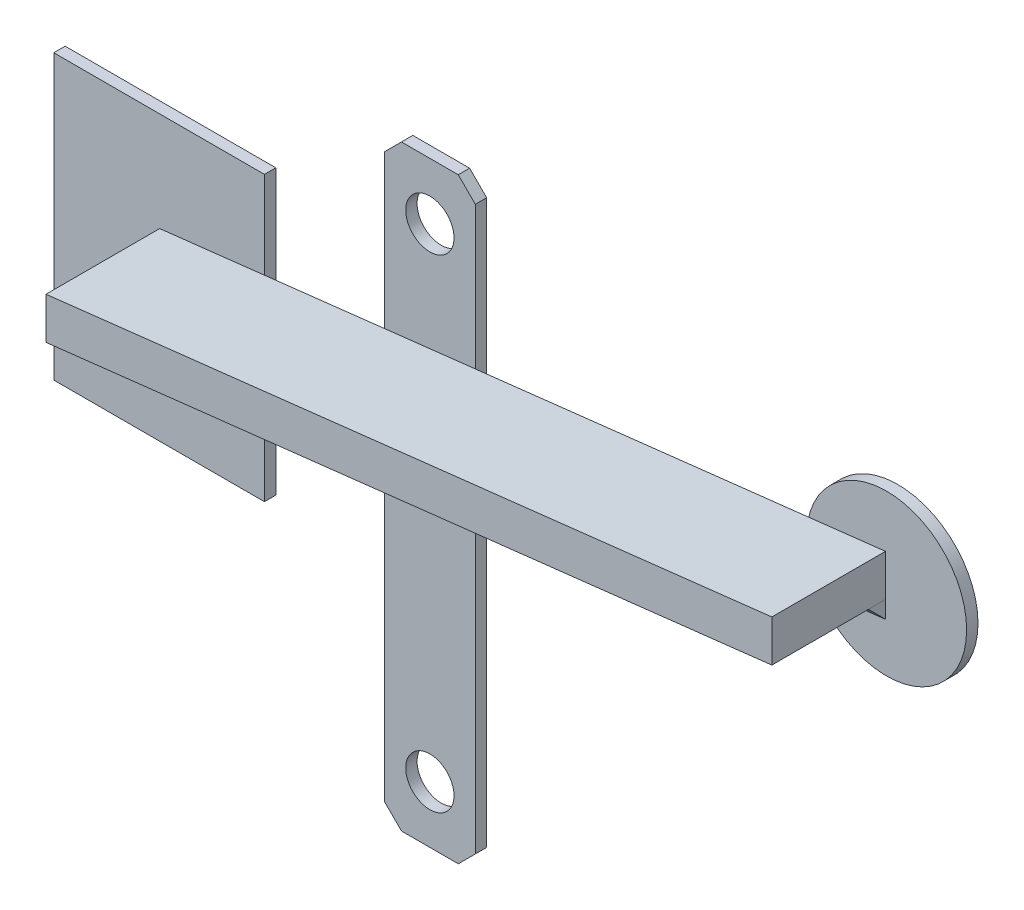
ISO-10303-21;
HEADER;
FILE_DESCRIPTION(('STEP AP214'),'2;1');
FILE_NAME('part.step','',(''),(''),'','','');
FILE_SCHEMA(('AUTOMOTIVE_DESIGN { 1 0 10303 214 1 1 1 1 }'));
ENDSEC;
DATA;
#1=APPLICATION_CONTEXT('core data for automotive mechanical design processes');
#2=APPLICATION_PROTOCOL_DEFINITION('international standard','automotive_design',2000,#1);
#3=PRODUCT_CONTEXT('',#1,'mechanical');
#4=PRODUCT('Part','Part','',(#3));
#5=PRODUCT_RELATED_PRODUCT_CATEGORY('part','',(#4));
#6=PRODUCT_DEFINITION_FORMATION('','',#4);
#7=PRODUCT_DEFINITION_CONTEXT('part definition',#1,'design');
#8=PRODUCT_DEFINITION('design','',#6,#7);
#9=PRODUCT_DEFINITION_SHAPE('','',#8);
#10=(LENGTH_UNIT() NAMED_UNIT(*) SI_UNIT(.MILLI.,.METRE.));
#11=(NAMED_UNIT(*) PLANE_ANGLE_UNIT() SI_UNIT($,.RADIAN.));
#12=(NAMED_UNIT(*) SI_UNIT($,.STERADIAN.) SOLID_ANGLE_UNIT());
#13=UNCERTAINTY_MEASURE_WITH_UNIT(LENGTH_MEASURE(1.E-05),#10,'distance_accuracy_value','');
#14=(GEOMETRIC_REPRESENTATION_CONTEXT(3) GLOBAL_UNCERTAINTY_ASSIGNED_CONTEXT((#13)) GLOBAL_UNIT_ASSIGNED_CONTEXT((#10,
#11,#12)) REPRESENTATION_CONTEXT('',''));
#15=CARTESIAN_POINT('',(0.,0.,0.));
#16=DIRECTION('',(0.,0.,1.));
#17=DIRECTION('',(1.,0.,0.));
#18=AXIS2_PLACEMENT_3D('',#15,#16,#17);
#19=CARTESIAN_POINT('',(80.1687632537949,32.7031653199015,22.));
#20=DIRECTION('',(-1.,0.,0.));
#21=DIRECTION('',(0.,0.,1.));
#22=AXIS2_PLACEMENT_3D('',#19,#20,#21);
#23=PLANE('',#22);
#24=DIRECTION('',(0.,0.,-1.));
#25=VECTOR('',#24,1.);
#26=CARTESIAN_POINT('',(80.1687632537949,25.3640538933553,22.));
#27=LINE('',#26,#25);
#28=CARTESIAN_POINT('',(80.1687632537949,25.3640538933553,4.99999999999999));
#29=VERTEX_POINT('',#28);
#30=CARTESIAN_POINT('',(80.1687632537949,25.3640538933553,2.));
#31=VERTEX_POINT('',#30);
#32=EDGE_CURVE('E86',#29,#31,#27,.T.);
#33=ORIENTED_EDGE('',*,*,#32,.F.);
#34=DIRECTION('',(0.,-0.709422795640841,-0.704783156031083));
#35=VECTOR('',#34,1.);
#36=CARTESIAN_POINT('',(80.1687632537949,37.5575040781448,17.1137047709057));
#37=LINE('',#36,#35);
#38=CARTESIAN_POINT('',(80.1687632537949,22.3443046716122,2.));
#39=VERTEX_POINT('',#38);
#40=EDGE_CURVE('E12',#29,#39,#37,.T.);
#41=ORIENTED_EDGE('',*,*,#40,.T.);
#42=DIRECTION('',(0.,1.,0.));
#43=VECTOR('',#42,1.);
#44=CARTESIAN_POINT('',(80.1687632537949,32.7031653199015,2.));
#45=LINE('',#44,#43);
#46=EDGE_CURVE('E73',#39,#31,#45,.T.);
#47=ORIENTED_EDGE('',*,*,#46,.T.);
#48=EDGE_LOOP('',(#33,#41,#47));
#49=FACE_BOUND('',#48,.T.);
#50=ADVANCED_FACE('F50',(#49),#23,.F.);
#51=CARTESIAN_POINT('',(80.353260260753,27.8853793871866,2.));
#52=DIRECTION('',(0.,0.,-1.));
#53=DIRECTION('',(-1.,0.,0.));
#54=AXIS2_PLACEMENT_3D('',#51,#52,#53);
#55=CYLINDRICAL_SURFACE('',#54,14.0926861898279);
#56=DIRECTION('',(0.,0.,-1.));
#57=VECTOR('',#56,1.);
#58=CARTESIAN_POINT('',(66.8554998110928,23.8339269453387,2.));
#59=LINE('',#58,#57);
#60=CARTESIAN_POINT('',(66.8554998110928,23.8339269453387,2.));
#61=VERTEX_POINT('',#60);
#62=CARTESIAN_POINT('',(66.8554998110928,23.8339269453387,4.99999999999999));
#63=VERTEX_POINT('',#62);
#64=EDGE_CURVE('E65',#61,#63,#59,.F.);
#65=ORIENTED_EDGE('',*,*,#64,.F.);
#66=CARTESIAN_POINT('',(80.353260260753,27.8853793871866,2.));
#67=DIRECTION('',(0.,0.,1.));
#68=DIRECTION('',(1.,0.,0.));
#69=AXIS2_PLACEMENT_3D('',#66,#67,#68);
#70=CIRCLE('',#69,14.0926861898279);
#71=CARTESIAN_POINT('',(68.0823140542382,20.9551785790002,2.));
#72=VERTEX_POINT('',#71);
#73=EDGE_CURVE('E87',#61,#72,#70,.T.);
#74=ORIENTED_EDGE('',*,*,#73,.T.);
#75=CARTESIAN_POINT('',(80.353260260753,27.8853793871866,7.48376994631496));
#76=DIRECTION('',(-0.0807380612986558,0.702482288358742,-0.707106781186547));
#77=DIRECTION('',(0.0807380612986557,-0.702482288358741,-0.707106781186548));
#78=AXIS2_PLACEMENT_3D('',#75,#76,#77);
#79=ELLIPSE('',#78,19.9300679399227,14.0926861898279);
#80=EDGE_CURVE('E58',#72,#63,#79,.T.);
#81=ORIENTED_EDGE('',*,*,#80,.T.);
#82=EDGE_LOOP('',(#65,#74,#81));
#83=FACE_BOUND('',#82,.T.);
#84=ADVANCED_FACE('F96',(#83),#55,.T.);
#85=CARTESIAN_POINT('',(80.97940183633,22.4374734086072,2.));
#86=DIRECTION('',(-0.0807380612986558,0.702482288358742,-0.707106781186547));
#87=DIRECTION('',(-0.99345997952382,-0.114180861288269,0.));
#88=AXIS2_PLACEMENT_3D('',#85,#86,#87);
#89=PLANE('',#88);
#90=ORIENTED_EDGE('',*,*,#40,.F.);
#91=DIRECTION('',(0.99345997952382,0.114180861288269,0.));
#92=VECTOR('',#91,1.);
#93=CARTESIAN_POINT('',(80.1687632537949,25.3640538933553,4.99999999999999));
#94=LINE('',#93,#92);
#95=EDGE_CURVE('E98',#63,#29,#94,.T.);
#96=ORIENTED_EDGE('',*,*,#95,.F.);
#97=ORIENTED_EDGE('',*,*,#80,.F.);
#98=DIRECTION('',(-0.99345997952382,-0.114180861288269,0.));
#99=VECTOR('',#98,1.);
#100=CARTESIAN_POINT('',(80.97940183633,22.4374734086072,2.));
#101=LINE('',#100,#99);
#102=EDGE_CURVE('E92',#39,#72,#101,.T.);
#103=ORIENTED_EDGE('',*,*,#102,.F.);
#104=EDGE_LOOP('',(#90,#96,#97,#103));
#105=FACE_BOUND('',#104,.T.);
#106=ADVANCED_FACE('F52',(#105),#89,.F.);
#107=CARTESIAN_POINT('',(80.353260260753,27.8853793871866,2.));
#108=DIRECTION('',(0.,0.,1.));
#109=DIRECTION('',(1.,0.,0.));
#110=AXIS2_PLACEMENT_3D('',#107,#108,#109);
#111=PLANE('',#110);
#112=ORIENTED_EDGE('',*,*,#102,.T.);
#113=ORIENTED_EDGE('',*,*,#73,.F.);
#114=DIRECTION('',(-0.99345997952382,-0.114180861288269,0.));
#115=VECTOR('',#114,1.);
#116=CARTESIAN_POINT('',(80.6368592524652,25.4178533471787,2.));
#117=LINE('',#116,#115);
#118=EDGE_CURVE('E82',#31,#61,#117,.T.);
#119=ORIENTED_EDGE('',*,*,#118,.F.);
#120=ORIENTED_EDGE('',*,*,#46,.F.);
#121=EDGE_LOOP('',(#112,#113,#119,#120));
#122=FACE_BOUND('',#121,.T.);
#123=ADVANCED_FACE('F90',(#122),#111,.F.);
#124=CARTESIAN_POINT('',(80.1687632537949,25.3640538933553,22.));
#125=DIRECTION('',(-0.114180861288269,0.99345997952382,0.));
#126=DIRECTION('',(-0.99345997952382,-0.114180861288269,0.));
#127=AXIS2_PLACEMENT_3D('',#124,#125,#126);
#128=PLANE('',#127);
#129=ORIENTED_EDGE('',*,*,#64,.T.);
#130=ORIENTED_EDGE('',*,*,#95,.T.);
#131=ORIENTED_EDGE('',*,*,#32,.T.);
#132=ORIENTED_EDGE('',*,*,#118,.T.);
#133=EDGE_LOOP('',(#129,#130,#131,#132));
#134=FACE_BOUND('',#133,.T.);
#135=ADVANCED_FACE('F84',(#134),#128,.T.);
#136=CLOSED_SHELL('',(#50,#84,#106,#123,#135));
#137=MANIFOLD_SOLID_BREP('B2',#136);
#138=CARTESIAN_POINT('',(8.00000000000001,49.5,2.));
#139=DIRECTION('',(-1.,0.,0.));
#140=DIRECTION('',(0.,0.,1.));
#141=AXIS2_PLACEMENT_3D('',#138,#139,#140);
#142=PLANE('',#141);
#143=DIRECTION('',(0.,1.,0.));
#144=VECTOR('',#143,1.);
#145=CARTESIAN_POINT('',(8.00000000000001,0.,2.));
#146=LINE('',#145,#144);
#147=CARTESIAN_POINT('',(8.00000000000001,14.0497666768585,2.));
#148=VERTEX_POINT('',#147);
#149=CARTESIAN_POINT('',(8.00000000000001,17.0695158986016,2.));
#150=VERTEX_POINT('',#149);
#151=EDGE_CURVE('E179',#148,#150,#146,.T.);
#152=ORIENTED_EDGE('',*,*,#151,.T.);
#153=DIRECTION('',(0.,0.,-1.));
#154=VECTOR('',#153,1.);
#155=CARTESIAN_POINT('',(8.00000000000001,17.0695158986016,2.));
#156=LINE('',#155,#154);
#157=CARTESIAN_POINT('',(8.00000000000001,17.0695158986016,4.99999999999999));
#158=VERTEX_POINT('',#157);
#159=EDGE_CURVE('E197',#158,#150,#156,.T.);
#160=ORIENTED_EDGE('',*,*,#159,.F.);
#161=DIRECTION('',(0.,0.709422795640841,0.704783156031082));
#162=VECTOR('',#161,1.);
#163=CARTESIAN_POINT('',(8.00000000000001,31.8911850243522,19.724735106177));
#164=LINE('',#163,#162);
#165=EDGE_CURVE('E48',#158,#148,#164,.F.);
#166=ORIENTED_EDGE('',*,*,#165,.T.);
#167=EDGE_LOOP('',(#152,#160,#166));
#168=FACE_BOUND('',#167,.T.);
#169=ADVANCED_FACE('F164',(#168),#142,.F.);
#170=CARTESIAN_POINT('',(-8.00000000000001,49.5,2.));
#171=DIRECTION('',(1.,0.,0.));
#172=DIRECTION('',(0.,0.,-1.));
#173=AXIS2_PLACEMENT_3D('',#170,#171,#172);
#174=PLANE('',#173);
#175=DIRECTION('',(0.,-1.,0.));
#176=VECTOR('',#175,1.);
#177=CARTESIAN_POINT('',(-8.00000000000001,0.,2.));
#178=LINE('',#177,#176);
#179=CARTESIAN_POINT('',(-8.00000000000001,15.2305955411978,2.));
#180=VERTEX_POINT('',#179);
#181=CARTESIAN_POINT('',(-8.00000000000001,12.2108463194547,2.));
#182=VERTEX_POINT('',#181);
#183=EDGE_CURVE('E207',#180,#182,#178,.T.);
#184=ORIENTED_EDGE('',*,*,#183,.T.);
#185=DIRECTION('',(0.,-0.709422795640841,-0.704783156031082));
#186=VECTOR('',#185,1.);
#187=CARTESIAN_POINT('',(-8.00000000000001,30.9777577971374,20.644175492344));
#188=LINE('',#187,#186);
#189=CARTESIAN_POINT('',(-8.00000000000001,15.2305955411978,4.99999999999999));
#190=VERTEX_POINT('',#189);
#191=EDGE_CURVE('E172',#182,#190,#188,.F.);
#192=ORIENTED_EDGE('',*,*,#191,.T.);
#193=DIRECTION('',(0.,0.,1.));
#194=VECTOR('',#193,1.);
#195=CARTESIAN_POINT('',(-8.00000000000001,15.2305955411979,2.));
#196=LINE('',#195,#194);
#197=EDGE_CURVE('E215',#180,#190,#196,.T.);
#198=ORIENTED_EDGE('',*,*,#197,.F.);
#199=EDGE_LOOP('',(#184,#192,#198));
#200=FACE_BOUND('',#199,.T.);
#201=ADVANCED_FACE('F219',(#200),#174,.F.);
#202=CARTESIAN_POINT('',(-1.48942471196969,12.9591231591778,2.));
#203=DIRECTION('',(0.0807380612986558,-0.702482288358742,0.707106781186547));
#204=DIRECTION('',(0.99345997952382,0.114180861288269,0.));
#205=AXIS2_PLACEMENT_3D('',#202,#203,#204);
#206=PLANE('',#205);
#207=ORIENTED_EDGE('',*,*,#165,.F.);
#208=DIRECTION('',(0.99345997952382,0.114180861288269,0.));
#209=VECTOR('',#208,1.);
#210=CARTESIAN_POINT('',(8.00000000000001,17.0695158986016,4.99999999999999));
#211=LINE('',#210,#209);
#212=EDGE_CURVE('E186',#190,#158,#211,.T.);
#213=ORIENTED_EDGE('',*,*,#212,.F.);
#214=ORIENTED_EDGE('',*,*,#191,.F.);
#215=DIRECTION('',(-0.99345997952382,-0.114180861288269,0.));
#216=VECTOR('',#215,1.);
#217=CARTESIAN_POINT('',(-7.65745741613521,12.2502156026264,2.));
#218=LINE('',#217,#216);
#219=EDGE_CURVE('E203',#148,#182,#218,.T.);
#220=ORIENTED_EDGE('',*,*,#219,.F.);
#221=EDGE_LOOP('',(#207,#213,#214,#220));
#222=FACE_BOUND('',#221,.T.);
#223=ADVANCED_FACE('F166',(#222),#206,.T.);
#224=CARTESIAN_POINT('',(80.1687632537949,25.3640538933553,22.));
#225=DIRECTION('',(-0.114180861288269,0.99345997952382,0.));
#226=DIRECTION('',(-0.99345997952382,-0.114180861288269,0.));
#227=AXIS2_PLACEMENT_3D('',#224,#225,#226);
#228=PLANE('',#227);
#229=ORIENTED_EDGE('',*,*,#159,.T.);
#230=DIRECTION('',(-0.99345997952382,-0.114180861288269,0.));
#231=VECTOR('',#230,1.);
#232=CARTESIAN_POINT('',(80.1687632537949,25.3640538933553,2.));
#233=LINE('',#232,#231);
#234=EDGE_CURVE('E199',#150,#180,#233,.T.);
#235=ORIENTED_EDGE('',*,*,#234,.T.);
#236=ORIENTED_EDGE('',*,*,#197,.T.);
#237=ORIENTED_EDGE('',*,*,#212,.T.);
#238=EDGE_LOOP('',(#229,#235,#236,#237));
#239=FACE_BOUND('',#238,.T.);
#240=ADVANCED_FACE('F198',(#239),#228,.T.);
#241=CARTESIAN_POINT('',(0.,0.,2.));
#242=DIRECTION('',(0.,0.,-1.));
#243=DIRECTION('',(-1.,0.,0.));
#244=AXIS2_PLACEMENT_3D('',#241,#242,#243);
#245=PLANE('',#244);
#246=ORIENTED_EDGE('',*,*,#219,.T.);
#247=ORIENTED_EDGE('',*,*,#183,.F.);
#248=ORIENTED_EDGE('',*,*,#234,.F.);
#249=ORIENTED_EDGE('',*,*,#151,.F.);
#250=EDGE_LOOP('',(#246,#247,#248,#249));
#251=FACE_BOUND('',#250,.T.);
#252=ADVANCED_FACE('F205',(#251),#245,.T.);
#253=CLOSED_SHELL('',(#169,#201,#223,#240,#252));
#254=MANIFOLD_SOLID_BREP('B6',#253);
#255=CARTESIAN_POINT('',(-47.5428935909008,10.6858310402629,22.));
#256=DIRECTION('',(1.,0.,0.));
#257=DIRECTION('',(0.,0.,-1.));
#258=AXIS2_PLACEMENT_3D('',#255,#256,#257);
#259=PLANE('',#258);
#260=DIRECTION('',(0.,0.,-1.));
#261=VECTOR('',#260,1.);
#262=CARTESIAN_POINT('',(-47.5428935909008,10.6858310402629,22.));
#263=LINE('',#262,#261);
#264=CARTESIAN_POINT('',(-47.5428935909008,10.6858310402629,4.99999999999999));
#265=VERTEX_POINT('',#264);
#266=CARTESIAN_POINT('',(-47.5428935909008,10.6858310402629,2.));
#267=VERTEX_POINT('',#266);
#268=EDGE_CURVE('E322',#265,#267,#263,.T.);
#269=ORIENTED_EDGE('',*,*,#268,.T.);
#270=DIRECTION('',(0.,-1.,0.));
#271=VECTOR('',#270,1.);
#272=CARTESIAN_POINT('',(-47.5428935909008,10.6858310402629,2.));
#273=LINE('',#272,#271);
#274=CARTESIAN_POINT('',(-47.5428935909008,7.66608181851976,2.));
#275=VERTEX_POINT('',#274);
#276=EDGE_CURVE('E318',#267,#275,#273,.T.);
#277=ORIENTED_EDGE('',*,*,#276,.T.);
#278=DIRECTION('',(0.,0.709422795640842,0.704783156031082));
#279=VECTOR('',#278,1.);
#280=CARTESIAN_POINT('',(-47.5428935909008,19.1856480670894,13.4442280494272));
#281=LINE('',#280,#279);
#282=EDGE_CURVE('E162',#275,#265,#281,.T.);
#283=ORIENTED_EDGE('',*,*,#282,.T.);
#284=EDGE_LOOP('',(#269,#277,#283));
#285=FACE_BOUND('',#284,.T.);
#286=ADVANCED_FACE('F278',(#285),#259,.F.);
#287=CARTESIAN_POINT('',(-29.10984391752,35.5062284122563,2.));
#288=DIRECTION('',(-1.,0.,0.));
#289=DIRECTION('',(0.,0.,1.));
#290=AXIS2_PLACEMENT_3D('',#287,#288,#289);
#291=PLANE('',#290);
#292=DIRECTION('',(0.,-0.709422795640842,-0.704783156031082));
#293=VECTOR('',#292,1.);
#294=CARTESIAN_POINT('',(-29.10984391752,22.7298184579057,14.8605180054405));
#295=LINE('',#294,#293);
#296=CARTESIAN_POINT('',(-29.10984391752,12.8043879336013,4.99999999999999));
#297=VERTEX_POINT('',#296);
#298=CARTESIAN_POINT('',(-29.10984391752,9.78463871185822,2.));
#299=VERTEX_POINT('',#298);
#300=EDGE_CURVE('E286',#297,#299,#295,.T.);
#301=ORIENTED_EDGE('',*,*,#300,.T.);
#302=DIRECTION('',(0.,1.,0.));
#303=VECTOR('',#302,1.);
#304=CARTESIAN_POINT('',(-29.10984391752,35.5062284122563,2.));
#305=LINE('',#304,#303);
#306=CARTESIAN_POINT('',(-29.10984391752,12.8043879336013,2.));
#307=VERTEX_POINT('',#306);
#308=EDGE_CURVE('E293',#299,#307,#305,.T.);
#309=ORIENTED_EDGE('',*,*,#308,.T.);
#310=DIRECTION('',(0.,0.,-1.));
#311=VECTOR('',#310,1.);
#312=CARTESIAN_POINT('',(-29.10984391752,12.8043879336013,2.));
#313=LINE('',#312,#311);
#314=EDGE_CURVE('E313',#297,#307,#313,.T.);
#315=ORIENTED_EDGE('',*,*,#314,.F.);
#316=EDGE_LOOP('',(#301,#309,#315));
#317=FACE_BOUND('',#316,.T.);
#318=ADVANCED_FACE('F324',(#317),#291,.F.);
#319=CARTESIAN_POINT('',(80.1687632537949,25.3640538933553,4.99999999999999));
#320=DIRECTION('',(-0.0807380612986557,0.702482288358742,-0.707106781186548));
#321=DIRECTION('',(0.99345997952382,0.114180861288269,0.));
#322=AXIS2_PLACEMENT_3D('',#319,#320,#321);
#323=PLANE('',#322);
#324=ORIENTED_EDGE('',*,*,#282,.F.);
#325=DIRECTION('',(-0.99345997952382,-0.114180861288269,0.));
#326=VECTOR('',#325,1.);
#327=CARTESIAN_POINT('',(-1.48942471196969,12.9591231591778,2.));
#328=LINE('',#327,#326);
#329=EDGE_CURVE('E331',#299,#275,#328,.T.);
#330=ORIENTED_EDGE('',*,*,#329,.F.);
#331=ORIENTED_EDGE('',*,*,#300,.F.);
#332=DIRECTION('',(0.99345997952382,0.114180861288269,0.));
#333=VECTOR('',#332,1.);
#334=CARTESIAN_POINT('',(80.1687632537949,25.3640538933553,4.99999999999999));
#335=LINE('',#334,#333);
#336=EDGE_CURVE('E301',#265,#297,#335,.T.);
#337=ORIENTED_EDGE('',*,*,#336,.F.);
#338=EDGE_LOOP('',(#324,#330,#331,#337));
#339=FACE_BOUND('',#338,.T.);
#340=ADVANCED_FACE('F280',(#339),#323,.F.);
#341=CARTESIAN_POINT('',(80.1687632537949,25.3640538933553,22.));
#342=DIRECTION('',(-0.114180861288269,0.99345997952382,0.));
#343=DIRECTION('',(-0.99345997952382,-0.114180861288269,0.));
#344=AXIS2_PLACEMENT_3D('',#341,#342,#343);
#345=PLANE('',#344);
#346=ORIENTED_EDGE('',*,*,#314,.T.);
#347=DIRECTION('',(0.99345997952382,0.114180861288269,0.));
#348=VECTOR('',#347,1.);
#349=CARTESIAN_POINT('',(80.1687632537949,25.3640538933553,2.));
#350=LINE('',#349,#348);
#351=EDGE_CURVE('E315',#267,#307,#350,.T.);
#352=ORIENTED_EDGE('',*,*,#351,.F.);
#353=ORIENTED_EDGE('',*,*,#268,.F.);
#354=ORIENTED_EDGE('',*,*,#336,.T.);
#355=EDGE_LOOP('',(#346,#352,#353,#354));
#356=FACE_BOUND('',#355,.T.);
#357=ADVANCED_FACE('F314',(#356),#345,.T.);
#358=CARTESIAN_POINT('',(0.,0.,2.));
#359=DIRECTION('',(0.,0.,1.));
#360=DIRECTION('',(1.,0.,0.));
#361=AXIS2_PLACEMENT_3D('',#358,#359,#360);
#362=PLANE('',#361);
#363=ORIENTED_EDGE('',*,*,#351,.T.);
#364=ORIENTED_EDGE('',*,*,#308,.F.);
#365=ORIENTED_EDGE('',*,*,#329,.T.);
#366=ORIENTED_EDGE('',*,*,#276,.F.);
#367=EDGE_LOOP('',(#363,#364,#365,#366));
#368=FACE_BOUND('',#367,.T.);
#369=ADVANCED_FACE('F320',(#368),#362,.F.);
#370=CLOSED_SHELL('',(#286,#318,#340,#357,#369));
#371=MANIFOLD_SOLID_BREP('B42',#370);
#372=CARTESIAN_POINT('',(-47.5428935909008,10.6858310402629,22.));
#373=DIRECTION('',(1.,0.,0.));
#374=DIRECTION('',(0.,0.,-1.));
#375=AXIS2_PLACEMENT_3D('',#372,#373,#374);
#376=PLANE('',#375);
#377=DIRECTION('',(0.,-1.,0.));
#378=VECTOR('',#377,1.);
#379=CARTESIAN_POINT('',(-47.5428935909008,10.6858310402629,2.));
#380=LINE('',#379,#378);
#381=CARTESIAN_POINT('',(-47.5428935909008,18.0249424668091,2.));
#382=VERTEX_POINT('',#381);
#383=CARTESIAN_POINT('',(-47.5428935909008,10.6858310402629,2.));
#384=VERTEX_POINT('',#383);
#385=EDGE_CURVE('E453',#382,#384,#380,.T.);
#386=ORIENTED_EDGE('',*,*,#385,.T.);
#387=DIRECTION('',(0.,0.,-1.));
#388=VECTOR('',#387,1.);
#389=CARTESIAN_POINT('',(-47.5428935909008,10.6858310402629,22.));
#390=LINE('',#389,#388);
#391=CARTESIAN_POINT('',(-47.5428935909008,10.6858310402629,22.));
#392=VERTEX_POINT('',#391);
#393=EDGE_CURVE('E276',#392,#384,#390,.T.);
#394=ORIENTED_EDGE('',*,*,#393,.F.);
#395=DIRECTION('',(0.,-1.,0.));
#396=VECTOR('',#395,1.);
#397=CARTESIAN_POINT('',(-47.5428935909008,10.6858310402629,22.));
#398=LINE('',#397,#396);
#399=CARTESIAN_POINT('',(-47.5428935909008,18.0249424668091,22.));
#400=VERTEX_POINT('',#399);
#401=EDGE_CURVE('E441',#400,#392,#398,.T.);
#402=ORIENTED_EDGE('',*,*,#401,.F.);
#403=DIRECTION('',(0.,0.,-1.));
#404=VECTOR('',#403,1.);
#405=CARTESIAN_POINT('',(-47.5428935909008,18.0249424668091,22.));
#406=LINE('',#405,#404);
#407=EDGE_CURVE('E449',#400,#382,#406,.T.);
#408=ORIENTED_EDGE('',*,*,#407,.T.);
#409=EDGE_LOOP('',(#386,#394,#402,#408));
#410=FACE_BOUND('',#409,.T.);
#411=ADVANCED_FACE('F390',(#410),#376,.F.);
#412=CARTESIAN_POINT('',(80.1687632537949,25.3640538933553,22.));
#413=DIRECTION('',(-0.114180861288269,0.99345997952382,0.));
#414=DIRECTION('',(-0.99345997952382,-0.114180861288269,0.));
#415=AXIS2_PLACEMENT_3D('',#412,#413,#414);
#416=PLANE('',#415);
#417=DIRECTION('',(0.99345997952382,0.114180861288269,0.));
#418=VECTOR('',#417,1.);
#419=CARTESIAN_POINT('',(80.1687632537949,25.3640538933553,2.));
#420=LINE('',#419,#418);
#421=CARTESIAN_POINT('',(80.1687632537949,25.3640538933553,2.));
#422=VERTEX_POINT('',#421);
#423=EDGE_CURVE('E445',#384,#422,#420,.T.);
#424=ORIENTED_EDGE('',*,*,#423,.T.);
#425=DIRECTION('',(0.,0.,-1.));
#426=VECTOR('',#425,1.);
#427=CARTESIAN_POINT('',(80.1687632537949,25.3640538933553,22.));
#428=LINE('',#427,#426);
#429=CARTESIAN_POINT('',(80.1687632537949,25.3640538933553,22.));
#430=VERTEX_POINT('',#429);
#431=EDGE_CURVE('E398',#430,#422,#428,.T.);
#432=ORIENTED_EDGE('',*,*,#431,.F.);
#433=DIRECTION('',(0.99345997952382,0.114180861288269,0.));
#434=VECTOR('',#433,1.);
#435=CARTESIAN_POINT('',(80.1687632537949,25.3640538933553,22.));
#436=LINE('',#435,#434);
#437=EDGE_CURVE('E436',#392,#430,#436,.T.);
#438=ORIENTED_EDGE('',*,*,#437,.F.);
#439=ORIENTED_EDGE('',*,*,#393,.T.);
#440=EDGE_LOOP('',(#424,#432,#438,#439));
#441=FACE_BOUND('',#440,.T.);
#442=ADVANCED_FACE('F444',(#441),#416,.F.);
#443=CARTESIAN_POINT('',(80.1687632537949,32.7031653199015,22.));
#444=DIRECTION('',(-1.,0.,0.));
#445=DIRECTION('',(0.,0.,1.));
#446=AXIS2_PLACEMENT_3D('',#443,#444,#445);
#447=PLANE('',#446);
#448=DIRECTION('',(0.,1.,0.));
#449=VECTOR('',#448,1.);
#450=CARTESIAN_POINT('',(80.1687632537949,32.7031653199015,2.));
#451=LINE('',#450,#449);
#452=CARTESIAN_POINT('',(80.1687632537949,32.7031653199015,2.));
#453=VERTEX_POINT('',#452);
#454=EDGE_CURVE('E423',#422,#453,#451,.T.);
#455=ORIENTED_EDGE('',*,*,#454,.T.);
#456=DIRECTION('',(0.,0.,-1.));
#457=VECTOR('',#456,1.);
#458=CARTESIAN_POINT('',(80.1687632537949,32.7031653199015,22.));
#459=LINE('',#458,#457);
#460=CARTESIAN_POINT('',(80.1687632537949,32.7031653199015,22.));
#461=VERTEX_POINT('',#460);
#462=EDGE_CURVE('E446',#461,#453,#459,.T.);
#463=ORIENTED_EDGE('',*,*,#462,.F.);
#464=DIRECTION('',(0.,1.,0.));
#465=VECTOR('',#464,1.);
#466=CARTESIAN_POINT('',(80.1687632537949,32.7031653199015,22.));
#467=LINE('',#466,#465);
#468=EDGE_CURVE('E439',#430,#461,#467,.T.);
#469=ORIENTED_EDGE('',*,*,#468,.F.);
#470=ORIENTED_EDGE('',*,*,#431,.T.);
#471=EDGE_LOOP('',(#455,#463,#469,#470));
#472=FACE_BOUND('',#471,.T.);
#473=ADVANCED_FACE('F447',(#472),#447,.F.);
#474=CARTESIAN_POINT('',(-47.5428935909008,18.0249424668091,22.));
#475=DIRECTION('',(0.114180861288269,-0.99345997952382,0.));
#476=DIRECTION('',(0.99345997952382,0.114180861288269,0.));
#477=AXIS2_PLACEMENT_3D('',#474,#475,#476);
#478=PLANE('',#477);
#479=DIRECTION('',(-0.99345997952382,-0.114180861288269,0.));
#480=VECTOR('',#479,1.);
#481=CARTESIAN_POINT('',(-47.5428935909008,18.0249424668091,2.));
#482=LINE('',#481,#480);
#483=EDGE_CURVE('E429',#453,#382,#482,.T.);
#484=ORIENTED_EDGE('',*,*,#483,.T.);
#485=ORIENTED_EDGE('',*,*,#407,.F.);
#486=DIRECTION('',(-0.99345997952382,-0.114180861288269,0.));
#487=VECTOR('',#486,1.);
#488=CARTESIAN_POINT('',(-47.5428935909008,18.0249424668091,22.));
#489=LINE('',#488,#487);
#490=EDGE_CURVE('E406',#461,#400,#489,.T.);
#491=ORIENTED_EDGE('',*,*,#490,.F.);
#492=ORIENTED_EDGE('',*,*,#462,.T.);
#493=EDGE_LOOP('',(#484,#485,#491,#492));
#494=FACE_BOUND('',#493,.T.);
#495=ADVANCED_FACE('F460',(#494),#478,.F.);
#496=CARTESIAN_POINT('',(0.,0.,22.));
#497=DIRECTION('',(0.,0.,-1.));
#498=DIRECTION('',(-1.,0.,0.));
#499=AXIS2_PLACEMENT_3D('',#496,#497,#498);
#500=PLANE('',#499);
#501=ORIENTED_EDGE('',*,*,#401,.T.);
#502=ORIENTED_EDGE('',*,*,#437,.T.);
#503=ORIENTED_EDGE('',*,*,#468,.T.);
#504=ORIENTED_EDGE('',*,*,#490,.T.);
#505=EDGE_LOOP('',(#501,#502,#503,#504));
#506=FACE_BOUND('',#505,.T.);
#507=ADVANCED_FACE('F437',(#506),#500,.F.);
#508=CARTESIAN_POINT('',(0.,0.,2.));
#509=DIRECTION('',(0.,0.,-1.));
#510=DIRECTION('',(-1.,0.,0.));
#511=AXIS2_PLACEMENT_3D('',#508,#509,#510);
#512=PLANE('',#511);
#513=ORIENTED_EDGE('',*,*,#385,.F.);
#514=ORIENTED_EDGE('',*,*,#483,.F.);
#515=ORIENTED_EDGE('',*,*,#454,.F.);
#516=ORIENTED_EDGE('',*,*,#423,.F.);
#517=EDGE_LOOP('',(#513,#514,#515,#516));
#518=FACE_BOUND('',#517,.T.);
#519=ADVANCED_FACE('F463',(#518),#512,.T.);
#520=CLOSED_SHELL('',(#411,#442,#473,#495,#507,#519));
#521=MANIFOLD_SOLID_BREP('B156',#520);
#522=CARTESIAN_POINT('',(80.353260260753,27.8853793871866,2.));
#523=DIRECTION('',(0.,0.,-1.));
#524=DIRECTION('',(-1.,0.,0.));
#525=AXIS2_PLACEMENT_3D('',#522,#523,#524);
#526=CYLINDRICAL_SURFACE('',#525,14.0926861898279);
#527=CARTESIAN_POINT('',(80.353260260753,27.8853793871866,2.));
#528=DIRECTION('',(0.,0.,1.));
#529=DIRECTION('',(1.,0.,0.));
#530=AXIS2_PLACEMENT_3D('',#527,#528,#529);
#531=CIRCLE('',#530,14.0926861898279);
#532=CARTESIAN_POINT('',(94.4459464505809,27.8853793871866,2.));
#533=VERTEX_POINT('',#532);
#534=EDGE_CURVE('E389',#533,#533,#531,.T.);
#535=ORIENTED_EDGE('',*,*,#534,.F.);
#536=EDGE_LOOP('',(#535));
#537=FACE_BOUND('',#536,.T.);
#538=CARTESIAN_POINT('',(80.353260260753,27.8853793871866,0.));
#539=DIRECTION('',(0.,0.,1.));
#540=DIRECTION('',(1.,0.,0.));
#541=AXIS2_PLACEMENT_3D('',#538,#539,#540);
#542=CIRCLE('',#541,14.0926861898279);
#543=CARTESIAN_POINT('',(94.4459464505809,27.8853793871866,0.));
#544=VERTEX_POINT('',#543);
#545=EDGE_CURVE('E527',#544,#544,#542,.T.);
#546=ORIENTED_EDGE('',*,*,#545,.T.);
#547=EDGE_LOOP('',(#546));
#548=FACE_BOUND('',#547,.T.);
#549=ADVANCED_FACE('F524',(#537,#548),#526,.T.);
#550=CARTESIAN_POINT('',(80.353260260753,27.8853793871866,2.));
#551=DIRECTION('',(0.,0.,1.));
#552=DIRECTION('',(1.,0.,0.));
#553=AXIS2_PLACEMENT_3D('',#550,#551,#552);
#554=PLANE('',#553);
#555=ORIENTED_EDGE('',*,*,#534,.T.);
#556=EDGE_LOOP('',(#555));
#557=FACE_BOUND('',#556,.T.);
#558=ADVANCED_FACE('F539',(#557),#554,.T.);
#559=CARTESIAN_POINT('',(80.353260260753,27.8853793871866,0.));
#560=DIRECTION('',(0.,0.,1.));
#561=DIRECTION('',(1.,0.,0.));
#562=AXIS2_PLACEMENT_3D('',#559,#560,#561);
#563=PLANE('',#562);
#564=ORIENTED_EDGE('',*,*,#545,.F.);
#565=EDGE_LOOP('',(#564));
#566=FACE_BOUND('',#565,.T.);
#567=ADVANCED_FACE('F537',(#566),#563,.F.);
#568=CLOSED_SHELL('',(#549,#558,#567));
#569=MANIFOLD_SOLID_BREP('B270',#568);
#570=CARTESIAN_POINT('',(-66.1748823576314,35.5062284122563,2.));
#571=DIRECTION('',(1.,0.,0.));
#572=DIRECTION('',(0.,0.,-1.));
#573=AXIS2_PLACEMENT_3D('',#570,#571,#572);
#574=PLANE('',#573);
#575=DIRECTION('',(0.,-1.,0.));
#576=VECTOR('',#575,1.);
#577=CARTESIAN_POINT('',(-66.1748823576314,35.5062284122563,0.));
#578=LINE('',#577,#576);
#579=CARTESIAN_POINT('',(-66.1748823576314,35.5062284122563,0.));
#580=VERTEX_POINT('',#579);
#581=CARTESIAN_POINT('',(-66.1748823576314,-14.3756924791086,0.));
#582=VERTEX_POINT('',#581);
#583=EDGE_CURVE('E637',#580,#582,#578,.T.);
#584=ORIENTED_EDGE('',*,*,#583,.T.);
#585=DIRECTION('',(0.,0.,-1.));
#586=VECTOR('',#585,1.);
#587=CARTESIAN_POINT('',(-66.1748823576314,-14.3756924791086,2.));
#588=LINE('',#587,#586);
#589=CARTESIAN_POINT('',(-66.1748823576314,-14.3756924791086,2.));
#590=VERTEX_POINT('',#589);
#591=EDGE_CURVE('E522',#590,#582,#588,.T.);
#592=ORIENTED_EDGE('',*,*,#591,.F.);
#593=DIRECTION('',(0.,-1.,0.));
#594=VECTOR('',#593,1.);
#595=CARTESIAN_POINT('',(-66.1748823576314,35.5062284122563,2.));
#596=LINE('',#595,#594);
#597=CARTESIAN_POINT('',(-66.1748823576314,35.5062284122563,2.));
#598=VERTEX_POINT('',#597);
#599=EDGE_CURVE('E625',#598,#590,#596,.T.);
#600=ORIENTED_EDGE('',*,*,#599,.F.);
#601=DIRECTION('',(0.,0.,-1.));
#602=VECTOR('',#601,1.);
#603=CARTESIAN_POINT('',(-66.1748823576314,35.5062284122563,2.));
#604=LINE('',#603,#602);
#605=EDGE_CURVE('E633',#598,#580,#604,.T.);
#606=ORIENTED_EDGE('',*,*,#605,.T.);
#607=EDGE_LOOP('',(#584,#592,#600,#606));
#608=FACE_BOUND('',#607,.T.);
#609=ADVANCED_FACE('F574',(#608),#574,.F.);
#610=CARTESIAN_POINT('',(-66.1748823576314,-14.3756924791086,2.));
#611=DIRECTION('',(0.,1.,0.));
#612=DIRECTION('',(0.,0.,1.));
#613=AXIS2_PLACEMENT_3D('',#610,#611,#612);
#614=PLANE('',#613);
#615=DIRECTION('',(1.,0.,0.));
#616=VECTOR('',#615,1.);
#617=CARTESIAN_POINT('',(-66.1748823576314,-14.3756924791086,0.));
#618=LINE('',#617,#616);
#619=CARTESIAN_POINT('',(-29.10984391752,-14.3756924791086,0.));
#620=VERTEX_POINT('',#619);
#621=EDGE_CURVE('E629',#582,#620,#618,.T.);
#622=ORIENTED_EDGE('',*,*,#621,.T.);
#623=DIRECTION('',(0.,0.,-1.));
#624=VECTOR('',#623,1.);
#625=CARTESIAN_POINT('',(-29.10984391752,-14.3756924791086,2.));
#626=LINE('',#625,#624);
#627=CARTESIAN_POINT('',(-29.10984391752,-14.3756924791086,2.));
#628=VERTEX_POINT('',#627);
#629=EDGE_CURVE('E582',#628,#620,#626,.T.);
#630=ORIENTED_EDGE('',*,*,#629,.F.);
#631=DIRECTION('',(1.,0.,0.));
#632=VECTOR('',#631,1.);
#633=CARTESIAN_POINT('',(-66.1748823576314,-14.3756924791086,2.));
#634=LINE('',#633,#632);
#635=EDGE_CURVE('E620',#590,#628,#634,.T.);
#636=ORIENTED_EDGE('',*,*,#635,.F.);
#637=ORIENTED_EDGE('',*,*,#591,.T.);
#638=EDGE_LOOP('',(#622,#630,#636,#637));
#639=FACE_BOUND('',#638,.T.);
#640=ADVANCED_FACE('F628',(#639),#614,.F.);
#641=CARTESIAN_POINT('',(-29.10984391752,35.5062284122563,2.));
#642=DIRECTION('',(-1.,0.,0.));
#643=DIRECTION('',(0.,0.,1.));
#644=AXIS2_PLACEMENT_3D('',#641,#642,#643);
#645=PLANE('',#644);
#646=DIRECTION('',(0.,1.,0.));
#647=VECTOR('',#646,1.);
#648=CARTESIAN_POINT('',(-29.10984391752,35.5062284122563,0.));
#649=LINE('',#648,#647);
#650=CARTESIAN_POINT('',(-29.10984391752,35.5062284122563,0.));
#651=VERTEX_POINT('',#650);
#652=EDGE_CURVE('E607',#620,#651,#649,.T.);
#653=ORIENTED_EDGE('',*,*,#652,.T.);
#654=DIRECTION('',(0.,0.,-1.));
#655=VECTOR('',#654,1.);
#656=CARTESIAN_POINT('',(-29.10984391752,35.5062284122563,2.));
#657=LINE('',#656,#655);
#658=CARTESIAN_POINT('',(-29.10984391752,35.5062284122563,2.));
#659=VERTEX_POINT('',#658);
#660=EDGE_CURVE('E630',#659,#651,#657,.T.);
#661=ORIENTED_EDGE('',*,*,#660,.F.);
#662=DIRECTION('',(0.,1.,0.));
#663=VECTOR('',#662,1.);
#664=CARTESIAN_POINT('',(-29.10984391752,35.5062284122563,2.));
#665=LINE('',#664,#663);
#666=EDGE_CURVE('E623',#628,#659,#665,.T.);
#667=ORIENTED_EDGE('',*,*,#666,.F.);
#668=ORIENTED_EDGE('',*,*,#629,.T.);
#669=EDGE_LOOP('',(#653,#661,#667,#668));
#670=FACE_BOUND('',#669,.T.);
#671=ADVANCED_FACE('F631',(#670),#645,.F.);
#672=CARTESIAN_POINT('',(-66.1748823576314,35.5062284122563,2.));
#673=DIRECTION('',(0.,-1.,0.));
#674=DIRECTION('',(0.,0.,-1.));
#675=AXIS2_PLACEMENT_3D('',#672,#673,#674);
#676=PLANE('',#675);
#677=DIRECTION('',(-1.,0.,0.));
#678=VECTOR('',#677,1.);
#679=CARTESIAN_POINT('',(-66.1748823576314,35.5062284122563,0.));
#680=LINE('',#679,#678);
#681=EDGE_CURVE('E613',#651,#580,#680,.T.);
#682=ORIENTED_EDGE('',*,*,#681,.T.);
#683=ORIENTED_EDGE('',*,*,#605,.F.);
#684=DIRECTION('',(-1.,0.,0.));
#685=VECTOR('',#684,1.);
#686=CARTESIAN_POINT('',(-66.1748823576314,35.5062284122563,2.));
#687=LINE('',#686,#685);
#688=EDGE_CURVE('E590',#659,#598,#687,.T.);
#689=ORIENTED_EDGE('',*,*,#688,.F.);
#690=ORIENTED_EDGE('',*,*,#660,.T.);
#691=EDGE_LOOP('',(#682,#683,#689,#690));
#692=FACE_BOUND('',#691,.T.);
#693=ADVANCED_FACE('F644',(#692),#676,.F.);
#694=CARTESIAN_POINT('',(0.,0.,2.));
#695=DIRECTION('',(0.,0.,1.));
#696=DIRECTION('',(1.,0.,0.));
#697=AXIS2_PLACEMENT_3D('',#694,#695,#696);
#698=PLANE('',#697);
#699=ORIENTED_EDGE('',*,*,#599,.T.);
#700=ORIENTED_EDGE('',*,*,#635,.T.);
#701=ORIENTED_EDGE('',*,*,#666,.T.);
#702=ORIENTED_EDGE('',*,*,#688,.T.);
#703=EDGE_LOOP('',(#699,#700,#701,#702));
#704=FACE_BOUND('',#703,.T.);
#705=ADVANCED_FACE('F621',(#704),#698,.T.);
#706=CARTESIAN_POINT('',(0.,0.,0.));
#707=DIRECTION('',(0.,0.,1.));
#708=DIRECTION('',(1.,0.,0.));
#709=AXIS2_PLACEMENT_3D('',#706,#707,#708);
#710=PLANE('',#709);
#711=ORIENTED_EDGE('',*,*,#583,.F.);
#712=ORIENTED_EDGE('',*,*,#681,.F.);
#713=ORIENTED_EDGE('',*,*,#652,.F.);
#714=ORIENTED_EDGE('',*,*,#621,.F.);
#715=EDGE_LOOP('',(#711,#712,#713,#714));
#716=FACE_BOUND('',#715,.T.);
#717=ADVANCED_FACE('F647',(#716),#710,.F.);
#718=CLOSED_SHELL('',(#609,#640,#671,#693,#705,#717));
#719=MANIFOLD_SOLID_BREP('B384',#718);
#720=CARTESIAN_POINT('',(0.,0.,2.));
#721=DIRECTION('',(0.,0.,-1.));
#722=DIRECTION('',(-1.,0.,0.));
#723=AXIS2_PLACEMENT_3D('',#720,#721,#722);
#724=PLANE('',#723);
#725=CARTESIAN_POINT('',(0.,42.5,2.));
#726=DIRECTION('',(0.,0.,1.));
#727=DIRECTION('',(1.,0.,0.));
#728=AXIS2_PLACEMENT_3D('',#725,#726,#727);
#729=CIRCLE('',#728,4.25);
#730=CARTESIAN_POINT('',(4.25,42.5,2.));
#731=VERTEX_POINT('',#730);
#732=EDGE_CURVE('E799',#731,#731,#729,.T.);
#733=ORIENTED_EDGE('',*,*,#732,.F.);
#734=EDGE_LOOP('',(#733));
#735=FACE_BOUND('',#734,.T.);
#736=DIRECTION('',(0.707106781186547,-0.707106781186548,0.));
#737=VECTOR('',#736,1.);
#738=CARTESIAN_POINT('',(-4.99999999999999,-52.5,2.));
#739=LINE('',#738,#737);
#740=CARTESIAN_POINT('',(-8.00000000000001,-49.5,2.));
#741=VERTEX_POINT('',#740);
#742=CARTESIAN_POINT('',(-4.99999999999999,-52.5,2.));
#743=VERTEX_POINT('',#742);
#744=EDGE_CURVE('E810',#741,#743,#739,.T.);
#745=ORIENTED_EDGE('',*,*,#744,.T.);
#746=DIRECTION('',(1.,0.,0.));
#747=VECTOR('',#746,1.);
#748=CARTESIAN_POINT('',(-4.99999999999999,-52.5,2.));
#749=LINE('',#748,#747);
#750=CARTESIAN_POINT('',(4.99999999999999,-52.5,2.));
#751=VERTEX_POINT('',#750);
#752=EDGE_CURVE('E758',#743,#751,#749,.T.);
#753=ORIENTED_EDGE('',*,*,#752,.T.);
#754=DIRECTION('',(0.707106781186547,0.707106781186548,0.));
#755=VECTOR('',#754,1.);
#756=CARTESIAN_POINT('',(4.99999999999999,-52.5,2.));
#757=LINE('',#756,#755);
#758=CARTESIAN_POINT('',(8.00000000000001,-49.5,2.));
#759=VERTEX_POINT('',#758);
#760=EDGE_CURVE('E825',#751,#759,#757,.T.);
#761=ORIENTED_EDGE('',*,*,#760,.T.);
#762=DIRECTION('',(0.,1.,0.));
#763=VECTOR('',#762,1.);
#764=CARTESIAN_POINT('',(8.00000000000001,49.5,2.));
#765=LINE('',#764,#763);
#766=CARTESIAN_POINT('',(8.00000000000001,49.5,2.));
#767=VERTEX_POINT('',#766);
#768=EDGE_CURVE('E838',#759,#767,#765,.T.);
#769=ORIENTED_EDGE('',*,*,#768,.T.);
#770=DIRECTION('',(-0.707106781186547,0.707106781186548,0.));
#771=VECTOR('',#770,1.);
#772=CARTESIAN_POINT('',(4.99999999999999,52.5,2.));
#773=LINE('',#772,#771);
#774=CARTESIAN_POINT('',(4.99999999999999,52.5,2.));
#775=VERTEX_POINT('',#774);
#776=EDGE_CURVE('E777',#767,#775,#773,.T.);
#777=ORIENTED_EDGE('',*,*,#776,.T.);
#778=DIRECTION('',(-1.,0.,0.));
#779=VECTOR('',#778,1.);
#780=CARTESIAN_POINT('',(-4.99999999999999,52.5,2.));
#781=LINE('',#780,#779);
#782=CARTESIAN_POINT('',(-4.99999999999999,52.5,2.));
#783=VERTEX_POINT('',#782);
#784=EDGE_CURVE('E771',#775,#783,#781,.T.);
#785=ORIENTED_EDGE('',*,*,#784,.T.);
#786=DIRECTION('',(-0.707106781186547,-0.707106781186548,0.));
#787=VECTOR('',#786,1.);
#788=CARTESIAN_POINT('',(-8.00000000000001,49.5,2.));
#789=LINE('',#788,#787);
#790=CARTESIAN_POINT('',(-8.00000000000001,49.5,2.));
#791=VERTEX_POINT('',#790);
#792=EDGE_CURVE('E775',#783,#791,#789,.T.);
#793=ORIENTED_EDGE('',*,*,#792,.T.);
#794=DIRECTION('',(0.,-1.,0.));
#795=VECTOR('',#794,1.);
#796=CARTESIAN_POINT('',(-8.00000000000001,49.5,2.));
#797=LINE('',#796,#795);
#798=EDGE_CURVE('E715',#791,#741,#797,.T.);
#799=ORIENTED_EDGE('',*,*,#798,.T.);
#800=EDGE_LOOP('',(#745,#753,#761,#769,#777,#785,#793,#799));
#801=FACE_BOUND('',#800,.T.);
#802=CARTESIAN_POINT('',(0.,-42.5,2.));
#803=DIRECTION('',(0.,0.,1.));
#804=DIRECTION('',(1.,0.,0.));
#805=AXIS2_PLACEMENT_3D('',#802,#803,#804);
#806=CIRCLE('',#805,4.25);
#807=CARTESIAN_POINT('',(4.25,-42.5,2.));
#808=VERTEX_POINT('',#807);
#809=EDGE_CURVE('E847',#808,#808,#806,.T.);
#810=ORIENTED_EDGE('',*,*,#809,.F.);
#811=EDGE_LOOP('',(#810));
#812=FACE_BOUND('',#811,.T.);
#813=ADVANCED_FACE('F698',(#735,#801,#812),#724,.F.);
#814=CARTESIAN_POINT('',(0.,0.,0.));
#815=DIRECTION('',(0.,0.,-1.));
#816=DIRECTION('',(-1.,0.,0.));
#817=AXIS2_PLACEMENT_3D('',#814,#815,#816);
#818=PLANE('',#817);
#819=CARTESIAN_POINT('',(0.,42.5,0.));
#820=DIRECTION('',(0.,0.,1.));
#821=DIRECTION('',(1.,0.,0.));
#822=AXIS2_PLACEMENT_3D('',#819,#820,#821);
#823=CIRCLE('',#822,4.25);
#824=CARTESIAN_POINT('',(4.25,42.5,0.));
#825=VERTEX_POINT('',#824);
#826=EDGE_CURVE('E844',#825,#825,#823,.T.);
#827=ORIENTED_EDGE('',*,*,#826,.T.);
#828=EDGE_LOOP('',(#827));
#829=FACE_BOUND('',#828,.T.);
#830=DIRECTION('',(0.707106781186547,-0.707106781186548,0.));
#831=VECTOR('',#830,1.);
#832=CARTESIAN_POINT('',(-4.99999999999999,-52.5,0.));
#833=LINE('',#832,#831);
#834=CARTESIAN_POINT('',(-8.00000000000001,-49.5,0.));
#835=VERTEX_POINT('',#834);
#836=CARTESIAN_POINT('',(-4.99999999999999,-52.5,0.));
#837=VERTEX_POINT('',#836);
#838=EDGE_CURVE('E795',#835,#837,#833,.T.);
#839=ORIENTED_EDGE('',*,*,#838,.F.);
#840=DIRECTION('',(0.,-1.,0.));
#841=VECTOR('',#840,1.);
#842=CARTESIAN_POINT('',(-8.00000000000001,49.5,0.));
#843=LINE('',#842,#841);
#844=CARTESIAN_POINT('',(-8.00000000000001,49.5,0.));
#845=VERTEX_POINT('',#844);
#846=EDGE_CURVE('E750',#845,#835,#843,.T.);
#847=ORIENTED_EDGE('',*,*,#846,.F.);
#848=DIRECTION('',(-0.707106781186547,-0.707106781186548,0.));
#849=VECTOR('',#848,1.);
#850=CARTESIAN_POINT('',(-8.00000000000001,49.5,0.));
#851=LINE('',#850,#849);
#852=CARTESIAN_POINT('',(-4.99999999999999,52.5,0.));
#853=VERTEX_POINT('',#852);
#854=EDGE_CURVE('E744',#853,#845,#851,.T.);
#855=ORIENTED_EDGE('',*,*,#854,.F.);
#856=DIRECTION('',(-1.,0.,0.));
#857=VECTOR('',#856,1.);
#858=CARTESIAN_POINT('',(-4.99999999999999,52.5,0.));
#859=LINE('',#858,#857);
#860=CARTESIAN_POINT('',(4.99999999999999,52.5,0.));
#861=VERTEX_POINT('',#860);
#862=EDGE_CURVE('E785',#861,#853,#859,.T.);
#863=ORIENTED_EDGE('',*,*,#862,.F.);
#864=DIRECTION('',(-0.707106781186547,0.707106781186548,0.));
#865=VECTOR('',#864,1.);
#866=CARTESIAN_POINT('',(4.99999999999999,52.5,0.));
#867=LINE('',#866,#865);
#868=CARTESIAN_POINT('',(8.00000000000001,49.5,0.));
#869=VERTEX_POINT('',#868);
#870=EDGE_CURVE('E805',#869,#861,#867,.T.);
#871=ORIENTED_EDGE('',*,*,#870,.F.);
#872=DIRECTION('',(0.,1.,0.));
#873=VECTOR('',#872,1.);
#874=CARTESIAN_POINT('',(8.00000000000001,49.5,0.));
#875=LINE('',#874,#873);
#876=CARTESIAN_POINT('',(8.00000000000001,-49.5,0.));
#877=VERTEX_POINT('',#876);
#878=EDGE_CURVE('E803',#877,#869,#875,.T.);
#879=ORIENTED_EDGE('',*,*,#878,.F.);
#880=DIRECTION('',(0.707106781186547,0.707106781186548,0.));
#881=VECTOR('',#880,1.);
#882=CARTESIAN_POINT('',(4.99999999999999,-52.5,0.));
#883=LINE('',#882,#881);
#884=CARTESIAN_POINT('',(4.99999999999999,-52.5,0.));
#885=VERTEX_POINT('',#884);
#886=EDGE_CURVE('E801',#885,#877,#883,.T.);
#887=ORIENTED_EDGE('',*,*,#886,.F.);
#888=DIRECTION('',(1.,0.,0.));
#889=VECTOR('',#888,1.);
#890=CARTESIAN_POINT('',(-4.99999999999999,-52.5,0.));
#891=LINE('',#890,#889);
#892=EDGE_CURVE('E798',#837,#885,#891,.T.);
#893=ORIENTED_EDGE('',*,*,#892,.F.);
#894=EDGE_LOOP('',(#839,#847,#855,#863,#871,#879,#887,#893));
#895=FACE_BOUND('',#894,.T.);
#896=CARTESIAN_POINT('',(0.,-42.5,0.));
#897=DIRECTION('',(0.,0.,1.));
#898=DIRECTION('',(1.,0.,0.));
#899=AXIS2_PLACEMENT_3D('',#896,#897,#898);
#900=CIRCLE('',#899,4.25);
#901=CARTESIAN_POINT('',(4.25,-42.5,0.));
#902=VERTEX_POINT('',#901);
#903=EDGE_CURVE('E850',#902,#902,#900,.T.);
#904=ORIENTED_EDGE('',*,*,#903,.T.);
#905=EDGE_LOOP('',(#904));
#906=FACE_BOUND('',#905,.T.);
#907=ADVANCED_FACE('F829',(#829,#895,#906),#818,.T.);
#908=CARTESIAN_POINT('',(-4.99999999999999,-52.5,2.));
#909=DIRECTION('',(0.707106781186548,0.707106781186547,0.));
#910=DIRECTION('',(-0.707106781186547,0.707106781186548,0.));
#911=AXIS2_PLACEMENT_3D('',#908,#909,#910);
#912=PLANE('',#911);
#913=ORIENTED_EDGE('',*,*,#838,.T.);
#914=DIRECTION('',(0.,0.,-1.));
#915=VECTOR('',#914,1.);
#916=CARTESIAN_POINT('',(-4.99999999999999,-52.5,2.));
#917=LINE('',#916,#915);
#918=EDGE_CURVE('E572',#743,#837,#917,.T.);
#919=ORIENTED_EDGE('',*,*,#918,.F.);
#920=ORIENTED_EDGE('',*,*,#744,.F.);
#921=DIRECTION('',(0.,0.,-1.));
#922=VECTOR('',#921,1.);
#923=CARTESIAN_POINT('',(-8.00000000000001,-49.5,2.));
#924=LINE('',#923,#922);
#925=EDGE_CURVE('E791',#741,#835,#924,.T.);
#926=ORIENTED_EDGE('',*,*,#925,.T.);
#927=EDGE_LOOP('',(#913,#919,#920,#926));
#928=FACE_BOUND('',#927,.T.);
#929=ADVANCED_FACE('F700',(#928),#912,.F.);
#930=CARTESIAN_POINT('',(-4.99999999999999,-52.5,2.));
#931=DIRECTION('',(0.,1.,0.));
#932=DIRECTION('',(0.,0.,1.));
#933=AXIS2_PLACEMENT_3D('',#930,#931,#932);
#934=PLANE('',#933);
#935=ORIENTED_EDGE('',*,*,#892,.T.);
#936=DIRECTION('',(0.,0.,-1.));
#937=VECTOR('',#936,1.);
#938=CARTESIAN_POINT('',(4.99999999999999,-52.5,2.));
#939=LINE('',#938,#937);
#940=EDGE_CURVE('E707',#751,#885,#939,.T.);
#941=ORIENTED_EDGE('',*,*,#940,.F.);
#942=ORIENTED_EDGE('',*,*,#752,.F.);
#943=ORIENTED_EDGE('',*,*,#918,.T.);
#944=EDGE_LOOP('',(#935,#941,#942,#943));
#945=FACE_BOUND('',#944,.T.);
#946=ADVANCED_FACE('F883',(#945),#934,.F.);
#947=CARTESIAN_POINT('',(4.99999999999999,-52.5,2.));
#948=DIRECTION('',(-0.707106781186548,0.707106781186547,0.));
#949=DIRECTION('',(-0.707106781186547,-0.707106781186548,0.));
#950=AXIS2_PLACEMENT_3D('',#947,#948,#949);
#951=PLANE('',#950);
#952=ORIENTED_EDGE('',*,*,#886,.T.);
#953=DIRECTION('',(0.,0.,-1.));
#954=VECTOR('',#953,1.);
#955=CARTESIAN_POINT('',(8.00000000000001,-49.5,2.));
#956=LINE('',#955,#954);
#957=EDGE_CURVE('E817',#759,#877,#956,.T.);
#958=ORIENTED_EDGE('',*,*,#957,.F.);
#959=ORIENTED_EDGE('',*,*,#760,.F.);
#960=ORIENTED_EDGE('',*,*,#940,.T.);
#961=EDGE_LOOP('',(#952,#958,#959,#960));
#962=FACE_BOUND('',#961,.T.);
#963=ADVANCED_FACE('F823',(#962),#951,.F.);
#964=CARTESIAN_POINT('',(8.00000000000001,49.5,2.));
#965=DIRECTION('',(-1.,0.,0.));
#966=DIRECTION('',(0.,0.,1.));
#967=AXIS2_PLACEMENT_3D('',#964,#965,#966);
#968=PLANE('',#967);
#969=ORIENTED_EDGE('',*,*,#878,.T.);
#970=DIRECTION('',(0.,0.,-1.));
#971=VECTOR('',#970,1.);
#972=CARTESIAN_POINT('',(8.00000000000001,49.5,2.));
#973=LINE('',#972,#971);
#974=EDGE_CURVE('E814',#767,#869,#973,.T.);
#975=ORIENTED_EDGE('',*,*,#974,.F.);
#976=ORIENTED_EDGE('',*,*,#768,.F.);
#977=ORIENTED_EDGE('',*,*,#957,.T.);
#978=EDGE_LOOP('',(#969,#975,#976,#977));
#979=FACE_BOUND('',#978,.T.);
#980=ADVANCED_FACE('F834',(#979),#968,.F.);
#981=CARTESIAN_POINT('',(4.99999999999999,52.5,2.));
#982=DIRECTION('',(-0.707106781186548,-0.707106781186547,0.));
#983=DIRECTION('',(0.707106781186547,-0.707106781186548,0.));
#984=AXIS2_PLACEMENT_3D('',#981,#982,#983);
#985=PLANE('',#984);
#986=ORIENTED_EDGE('',*,*,#870,.T.);
#987=DIRECTION('',(0.,0.,-1.));
#988=VECTOR('',#987,1.);
#989=CARTESIAN_POINT('',(4.99999999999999,52.5,2.));
#990=LINE('',#989,#988);
#991=EDGE_CURVE('E786',#775,#861,#990,.T.);
#992=ORIENTED_EDGE('',*,*,#991,.F.);
#993=ORIENTED_EDGE('',*,*,#776,.F.);
#994=ORIENTED_EDGE('',*,*,#974,.T.);
#995=EDGE_LOOP('',(#986,#992,#993,#994));
#996=FACE_BOUND('',#995,.T.);
#997=ADVANCED_FACE('F837',(#996),#985,.F.);
#998=CARTESIAN_POINT('',(-4.99999999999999,52.5,2.));
#999=DIRECTION('',(0.,-1.,0.));
#1000=DIRECTION('',(0.,0.,-1.));
#1001=AXIS2_PLACEMENT_3D('',#998,#999,#1000);
#1002=PLANE('',#1001);
#1003=ORIENTED_EDGE('',*,*,#862,.T.);
#1004=DIRECTION('',(0.,0.,-1.));
#1005=VECTOR('',#1004,1.);
#1006=CARTESIAN_POINT('',(-4.99999999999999,52.5,2.));
#1007=LINE('',#1006,#1005);
#1008=EDGE_CURVE('E782',#783,#853,#1007,.T.);
#1009=ORIENTED_EDGE('',*,*,#1008,.F.);
#1010=ORIENTED_EDGE('',*,*,#784,.F.);
#1011=ORIENTED_EDGE('',*,*,#991,.T.);
#1012=EDGE_LOOP('',(#1003,#1009,#1010,#1011));
#1013=FACE_BOUND('',#1012,.T.);
#1014=ADVANCED_FACE('F783',(#1013),#1002,.F.);
#1015=CARTESIAN_POINT('',(-8.00000000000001,49.5,2.));
#1016=DIRECTION('',(0.707106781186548,-0.707106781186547,0.));
#1017=DIRECTION('',(0.707106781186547,0.707106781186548,0.));
#1018=AXIS2_PLACEMENT_3D('',#1015,#1016,#1017);
#1019=PLANE('',#1018);
#1020=ORIENTED_EDGE('',*,*,#854,.T.);
#1021=DIRECTION('',(0.,0.,-1.));
#1022=VECTOR('',#1021,1.);
#1023=CARTESIAN_POINT('',(-8.00000000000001,49.5,2.));
#1024=LINE('',#1023,#1022);
#1025=EDGE_CURVE('E787',#791,#845,#1024,.T.);
#1026=ORIENTED_EDGE('',*,*,#1025,.F.);
#1027=ORIENTED_EDGE('',*,*,#792,.F.);
#1028=ORIENTED_EDGE('',*,*,#1008,.T.);
#1029=EDGE_LOOP('',(#1020,#1026,#1027,#1028));
#1030=FACE_BOUND('',#1029,.T.);
#1031=ADVANCED_FACE('F789',(#1030),#1019,.F.);
#1032=CARTESIAN_POINT('',(-8.00000000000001,49.5,2.));
#1033=DIRECTION('',(1.,0.,0.));
#1034=DIRECTION('',(0.,0.,-1.));
#1035=AXIS2_PLACEMENT_3D('',#1032,#1033,#1034);
#1036=PLANE('',#1035);
#1037=ORIENTED_EDGE('',*,*,#846,.T.);
#1038=ORIENTED_EDGE('',*,*,#925,.F.);
#1039=ORIENTED_EDGE('',*,*,#798,.F.);
#1040=ORIENTED_EDGE('',*,*,#1025,.T.);
#1041=EDGE_LOOP('',(#1037,#1038,#1039,#1040));
#1042=FACE_BOUND('',#1041,.T.);
#1043=ADVANCED_FACE('F871',(#1042),#1036,.F.);
#1044=CARTESIAN_POINT('',(0.,42.5,2.));
#1045=DIRECTION('',(0.,0.,-1.));
#1046=DIRECTION('',(-1.,0.,0.));
#1047=AXIS2_PLACEMENT_3D('',#1044,#1045,#1046);
#1048=CYLINDRICAL_SURFACE('',#1047,4.25);
#1049=ORIENTED_EDGE('',*,*,#732,.T.);
#1050=EDGE_LOOP('',(#1049));
#1051=FACE_BOUND('',#1050,.T.);
#1052=ORIENTED_EDGE('',*,*,#826,.F.);
#1053=EDGE_LOOP('',(#1052));
#1054=FACE_BOUND('',#1053,.T.);
#1055=ADVANCED_FACE('F868',(#1051,#1054),#1048,.F.);
#1056=CARTESIAN_POINT('',(0.,-42.5,2.));
#1057=DIRECTION('',(0.,0.,-1.));
#1058=DIRECTION('',(-1.,0.,0.));
#1059=AXIS2_PLACEMENT_3D('',#1056,#1057,#1058);
#1060=CYLINDRICAL_SURFACE('',#1059,4.25);
#1061=ORIENTED_EDGE('',*,*,#809,.T.);
#1062=EDGE_LOOP('',(#1061));
#1063=FACE_BOUND('',#1062,.T.);
#1064=ORIENTED_EDGE('',*,*,#903,.F.);
#1065=EDGE_LOOP('',(#1064));
#1066=FACE_BOUND('',#1065,.T.);
#1067=ADVANCED_FACE('F856',(#1063,#1066),#1060,.F.);
#1068=CLOSED_SHELL('',(#813,#907,#929,#946,#963,#980,#997,#1014,#1031,#1043,#1055,#1067));
#1069=MANIFOLD_SOLID_BREP('B516',#1068);
#1070=ADVANCED_BREP_SHAPE_REPRESENTATION('',(#18,#137,#254,#371,#521,#569,#719,#1069),#14);
#1071=SHAPE_DEFINITION_REPRESENTATION(#9,#1070);
ENDSEC;
END-ISO-10303-21;
